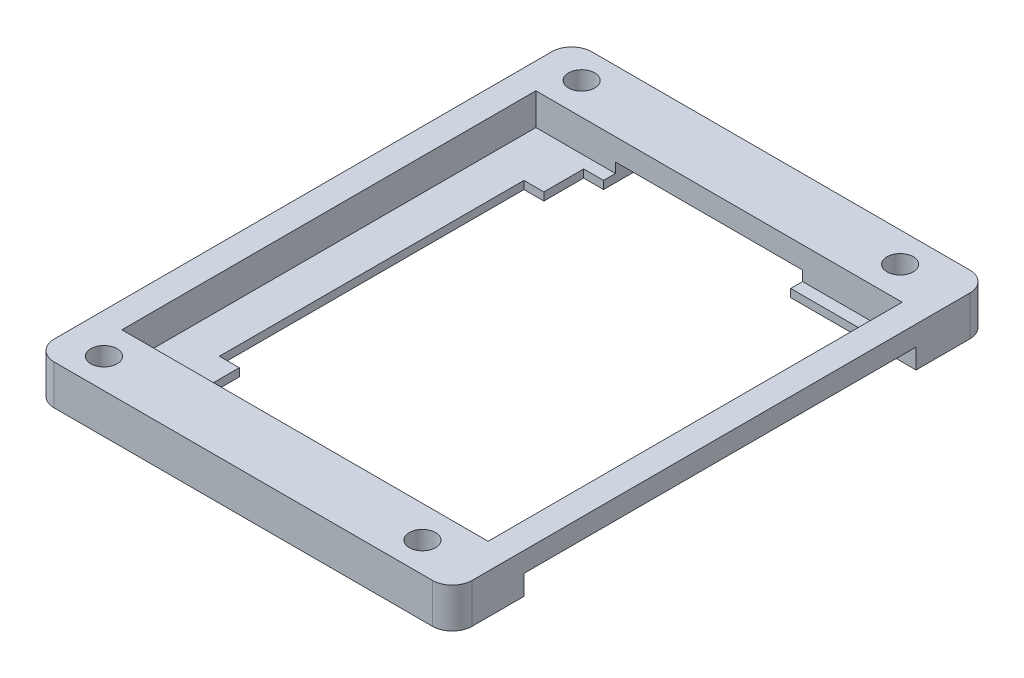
ISO-10303-21;
HEADER;
FILE_DESCRIPTION(('STEP AP214'),'2;1');
FILE_NAME('part.step','',(''),(''),'','','');
FILE_SCHEMA(('AUTOMOTIVE_DESIGN { 1 0 10303 214 1 1 1 1 }'));
ENDSEC;
DATA;
#1=APPLICATION_CONTEXT('core data for automotive mechanical design processes');
#2=APPLICATION_PROTOCOL_DEFINITION('international standard','automotive_design',2000,#1);
#3=PRODUCT_CONTEXT('',#1,'mechanical');
#4=PRODUCT('Part','Part','',(#3));
#5=PRODUCT_RELATED_PRODUCT_CATEGORY('part','',(#4));
#6=PRODUCT_DEFINITION_FORMATION('','',#4);
#7=PRODUCT_DEFINITION_CONTEXT('part definition',#1,'design');
#8=PRODUCT_DEFINITION('design','',#6,#7);
#9=PRODUCT_DEFINITION_SHAPE('','',#8);
#10=(LENGTH_UNIT() NAMED_UNIT(*) SI_UNIT(.MILLI.,.METRE.));
#11=(NAMED_UNIT(*) PLANE_ANGLE_UNIT() SI_UNIT($,.RADIAN.));
#12=(NAMED_UNIT(*) SI_UNIT($,.STERADIAN.) SOLID_ANGLE_UNIT());
#13=UNCERTAINTY_MEASURE_WITH_UNIT(LENGTH_MEASURE(1.E-05),#10,'distance_accuracy_value','');
#14=(GEOMETRIC_REPRESENTATION_CONTEXT(3) GLOBAL_UNCERTAINTY_ASSIGNED_CONTEXT((#13)) GLOBAL_UNIT_ASSIGNED_CONTEXT((#10,
#11,#12)) REPRESENTATION_CONTEXT('',''));
#15=CARTESIAN_POINT('',(0.,0.,0.));
#16=DIRECTION('',(0.,0.,1.));
#17=DIRECTION('',(1.,0.,0.));
#18=AXIS2_PLACEMENT_3D('',#15,#16,#17);
#19=CARTESIAN_POINT('',(-46.,10.,-52.));
#20=DIRECTION('',(0.,0.,1.));
#21=DIRECTION('',(1.,0.,0.));
#22=AXIS2_PLACEMENT_3D('',#19,#20,#21);
#23=PLANE('',#22);
#24=DIRECTION('',(-1.,0.,0.));
#25=VECTOR('',#24,1.);
#26=CARTESIAN_POINT('',(-26.,2.,-52.));
#27=LINE('',#26,#25);
#28=CARTESIAN_POINT('',(-26.,2.,-52.));
#29=VERTEX_POINT('',#28);
#30=CARTESIAN_POINT('',(-46.,2.,-52.));
#31=VERTEX_POINT('',#30);
#32=EDGE_CURVE('E319',#29,#31,#27,.T.);
#33=ORIENTED_EDGE('',*,*,#32,.F.);
#34=DIRECTION('',(0.,1.,0.));
#35=VECTOR('',#34,1.);
#36=CARTESIAN_POINT('',(-26.,-1.2E-05,-52.));
#37=LINE('',#36,#35);
#38=CARTESIAN_POINT('',(-26.,4.5,-52.));
#39=VERTEX_POINT('',#38);
#40=EDGE_CURVE('E265',#29,#39,#37,.T.);
#41=ORIENTED_EDGE('',*,*,#40,.T.);
#42=DIRECTION('',(-1.,0.,0.));
#43=VECTOR('',#42,1.);
#44=CARTESIAN_POINT('',(-26.,4.5,-52.));
#45=LINE('',#44,#43);
#46=CARTESIAN_POINT('',(21.,4.5,-52.));
#47=VERTEX_POINT('',#46);
#48=EDGE_CURVE('E255',#47,#39,#45,.T.);
#49=ORIENTED_EDGE('',*,*,#48,.F.);
#50=DIRECTION('',(0.,1.,0.));
#51=VECTOR('',#50,1.);
#52=CARTESIAN_POINT('',(21.,-1.2E-05,-52.));
#53=LINE('',#52,#51);
#54=CARTESIAN_POINT('',(21.,2.,-52.));
#55=VERTEX_POINT('',#54);
#56=EDGE_CURVE('E267',#55,#47,#53,.T.);
#57=ORIENTED_EDGE('',*,*,#56,.F.);
#58=DIRECTION('',(-1.,0.,0.));
#59=VECTOR('',#58,1.);
#60=CARTESIAN_POINT('',(46.,2.,-52.));
#61=LINE('',#60,#59);
#62=CARTESIAN_POINT('',(46.,2.,-52.));
#63=VERTEX_POINT('',#62);
#64=EDGE_CURVE('E306',#63,#55,#61,.T.);
#65=ORIENTED_EDGE('',*,*,#64,.F.);
#66=DIRECTION('',(0.,-1.,0.));
#67=VECTOR('',#66,1.);
#68=CARTESIAN_POINT('',(46.,10.,-52.));
#69=LINE('',#68,#67);
#70=CARTESIAN_POINT('',(46.,10.,-52.));
#71=VERTEX_POINT('',#70);
#72=EDGE_CURVE('E422',#71,#63,#69,.T.);
#73=ORIENTED_EDGE('',*,*,#72,.F.);
#74=DIRECTION('',(-1.,0.,0.));
#75=VECTOR('',#74,1.);
#76=CARTESIAN_POINT('',(-46.,10.,-52.));
#77=LINE('',#76,#75);
#78=CARTESIAN_POINT('',(-46.,10.,-52.));
#79=VERTEX_POINT('',#78);
#80=EDGE_CURVE('E406',#71,#79,#77,.T.);
#81=ORIENTED_EDGE('',*,*,#80,.T.);
#82=DIRECTION('',(0.,-1.,0.));
#83=VECTOR('',#82,1.);
#84=CARTESIAN_POINT('',(-46.,10.,-52.));
#85=LINE('',#84,#83);
#86=EDGE_CURVE('E419',#79,#31,#85,.T.);
#87=ORIENTED_EDGE('',*,*,#86,.T.);
#88=EDGE_LOOP('',(#33,#41,#49,#57,#65,#73,#81,#87));
#89=FACE_BOUND('',#88,.T.);
#90=ADVANCED_FACE('F39',(#89),#23,.T.);
#91=CARTESIAN_POINT('',(0.,0.,0.));
#92=DIRECTION('',(0.,-1.,0.));
#93=DIRECTION('',(0.,0.,-1.));
#94=AXIS2_PLACEMENT_3D('',#91,#92,#93);
#95=PLANE('',#94);
#96=CARTESIAN_POINT('',(-42.5,0.,60.));
#97=DIRECTION('',(0.,1.,0.));
#98=DIRECTION('',(0.,0.,1.));
#99=AXIS2_PLACEMENT_3D('',#96,#97,#98);
#100=CIRCLE('',#99,3.3);
#101=CARTESIAN_POINT('',(-42.5,0.,63.3));
#102=VERTEX_POINT('',#101);
#103=EDGE_CURVE('E384',#102,#102,#100,.T.);
#104=ORIENTED_EDGE('',*,*,#103,.T.);
#105=EDGE_LOOP('',(#104));
#106=FACE_BOUND('',#105,.T.);
#107=CARTESIAN_POINT('',(-42.5,0.,-60.));
#108=DIRECTION('',(0.,1.,0.));
#109=DIRECTION('',(0.,0.,1.));
#110=AXIS2_PLACEMENT_3D('',#107,#108,#109);
#111=CIRCLE('',#110,3.3);
#112=CARTESIAN_POINT('',(-42.5,0.,-56.7));
#113=VERTEX_POINT('',#112);
#114=EDGE_CURVE('E396',#113,#113,#111,.T.);
#115=ORIENTED_EDGE('',*,*,#114,.T.);
#116=EDGE_LOOP('',(#115));
#117=FACE_BOUND('',#116,.T.);
#118=CARTESIAN_POINT('',(37.5,0.,60.));
#119=DIRECTION('',(0.,1.,0.));
#120=DIRECTION('',(0.,0.,1.));
#121=AXIS2_PLACEMENT_3D('',#118,#119,#120);
#122=CIRCLE('',#121,3.3);
#123=CARTESIAN_POINT('',(37.5,0.,63.3));
#124=VERTEX_POINT('',#123);
#125=EDGE_CURVE('E380',#124,#124,#122,.T.);
#126=ORIENTED_EDGE('',*,*,#125,.T.);
#127=EDGE_LOOP('',(#126));
#128=FACE_BOUND('',#127,.T.);
#129=DIRECTION('',(0.,0.,-1.));
#130=VECTOR('',#129,1.);
#131=CARTESIAN_POINT('',(52.5,0.,67.5));
#132=LINE('',#131,#130);
#133=CARTESIAN_POINT('',(52.5,0.,62.5));
#134=VERTEX_POINT('',#133);
#135=CARTESIAN_POINT('',(52.5,0.,49.5156946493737));
#136=VERTEX_POINT('',#135);
#137=EDGE_CURVE('E438',#134,#136,#132,.T.);
#138=ORIENTED_EDGE('',*,*,#137,.F.);
#139=CARTESIAN_POINT('',(47.5,0.,62.5));
#140=DIRECTION('',(0.,-1.,0.));
#141=DIRECTION('',(0.,0.,-1.));
#142=AXIS2_PLACEMENT_3D('',#139,#140,#141);
#143=CIRCLE('',#142,5.);
#144=CARTESIAN_POINT('',(47.5,0.,67.5));
#145=VERTEX_POINT('',#144);
#146=EDGE_CURVE('E456',#134,#145,#143,.T.);
#147=ORIENTED_EDGE('',*,*,#146,.T.);
#148=DIRECTION('',(1.,0.,0.));
#149=VECTOR('',#148,1.);
#150=CARTESIAN_POINT('',(-52.5,0.,67.5));
#151=LINE('',#150,#149);
#152=CARTESIAN_POINT('',(-47.5,0.,67.5));
#153=VERTEX_POINT('',#152);
#154=EDGE_CURVE('E430',#153,#145,#151,.T.);
#155=ORIENTED_EDGE('',*,*,#154,.F.);
#156=CARTESIAN_POINT('',(-47.5,0.,62.5));
#157=DIRECTION('',(0.,-1.,0.));
#158=DIRECTION('',(0.,0.,-1.));
#159=AXIS2_PLACEMENT_3D('',#156,#157,#158);
#160=CIRCLE('',#159,5.);
#161=CARTESIAN_POINT('',(-52.5,0.,62.5));
#162=VERTEX_POINT('',#161);
#163=EDGE_CURVE('E454',#153,#162,#160,.T.);
#164=ORIENTED_EDGE('',*,*,#163,.T.);
#165=DIRECTION('',(0.,0.,1.));
#166=VECTOR('',#165,1.);
#167=CARTESIAN_POINT('',(-52.5,0.,67.5));
#168=LINE('',#167,#166);
#169=CARTESIAN_POINT('',(-52.5,0.,-62.5));
#170=VERTEX_POINT('',#169);
#171=EDGE_CURVE('E443',#170,#162,#168,.T.);
#172=ORIENTED_EDGE('',*,*,#171,.F.);
#173=CARTESIAN_POINT('',(-47.5,0.,-62.5));
#174=DIRECTION('',(0.,-1.,0.));
#175=DIRECTION('',(0.,0.,-1.));
#176=AXIS2_PLACEMENT_3D('',#173,#174,#175);
#177=CIRCLE('',#176,5.);
#178=CARTESIAN_POINT('',(-47.5,0.,-67.5));
#179=VERTEX_POINT('',#178);
#180=EDGE_CURVE('E452',#170,#179,#177,.T.);
#181=ORIENTED_EDGE('',*,*,#180,.T.);
#182=DIRECTION('',(-1.,0.,0.));
#183=VECTOR('',#182,1.);
#184=CARTESIAN_POINT('',(-52.5,0.,-67.5));
#185=LINE('',#184,#183);
#186=CARTESIAN_POINT('',(-26.,0.,-67.5));
#187=VERTEX_POINT('',#186);
#188=EDGE_CURVE('E440',#187,#179,#185,.T.);
#189=ORIENTED_EDGE('',*,*,#188,.F.);
#190=DIRECTION('',(0.,0.,-1.));
#191=VECTOR('',#190,1.);
#192=CARTESIAN_POINT('',(-26.,0.,-49.));
#193=LINE('',#192,#191);
#194=CARTESIAN_POINT('',(-26.,0.,-49.));
#195=VERTEX_POINT('',#194);
#196=EDGE_CURVE('E240',#195,#187,#193,.T.);
#197=ORIENTED_EDGE('',*,*,#196,.F.);
#198=DIRECTION('',(1.,0.,0.));
#199=VECTOR('',#198,1.);
#200=CARTESIAN_POINT('',(-31.,0.,-49.));
#201=LINE('',#200,#199);
#202=CARTESIAN_POINT('',(-31.,0.,-49.));
#203=VERTEX_POINT('',#202);
#204=EDGE_CURVE('E320',#203,#195,#201,.T.);
#205=ORIENTED_EDGE('',*,*,#204,.F.);
#206=DIRECTION('',(0.,0.,-1.));
#207=VECTOR('',#206,1.);
#208=CARTESIAN_POINT('',(-31.,0.,-49.));
#209=LINE('',#208,#207);
#210=CARTESIAN_POINT('',(-31.,0.,-39.));
#211=VERTEX_POINT('',#210);
#212=EDGE_CURVE('E355',#211,#203,#209,.T.);
#213=ORIENTED_EDGE('',*,*,#212,.F.);
#214=DIRECTION('',(1.,0.,0.));
#215=VECTOR('',#214,1.);
#216=CARTESIAN_POINT('',(-36.,0.,-39.));
#217=LINE('',#216,#215);
#218=CARTESIAN_POINT('',(-36.,0.,-39.));
#219=VERTEX_POINT('',#218);
#220=EDGE_CURVE('E353',#219,#211,#217,.T.);
#221=ORIENTED_EDGE('',*,*,#220,.F.);
#222=DIRECTION('',(0.,0.,-1.));
#223=VECTOR('',#222,1.);
#224=CARTESIAN_POINT('',(-36.,0.,37.5));
#225=LINE('',#224,#223);
#226=CARTESIAN_POINT('',(-36.,0.,37.5));
#227=VERTEX_POINT('',#226);
#228=EDGE_CURVE('E351',#227,#219,#225,.T.);
#229=ORIENTED_EDGE('',*,*,#228,.F.);
#230=DIRECTION('',(-1.,0.,0.));
#231=VECTOR('',#230,1.);
#232=CARTESIAN_POINT('',(-36.,0.,37.5));
#233=LINE('',#232,#231);
#234=CARTESIAN_POINT('',(-31.,0.,37.5));
#235=VERTEX_POINT('',#234);
#236=EDGE_CURVE('E349',#235,#227,#233,.T.);
#237=ORIENTED_EDGE('',*,*,#236,.F.);
#238=DIRECTION('',(0.,0.,-1.));
#239=VECTOR('',#238,1.);
#240=CARTESIAN_POINT('',(-31.,0.,49.5));
#241=LINE('',#240,#239);
#242=CARTESIAN_POINT('',(-31.,0.,49.5));
#243=VERTEX_POINT('',#242);
#244=EDGE_CURVE('E347',#243,#235,#241,.T.);
#245=ORIENTED_EDGE('',*,*,#244,.F.);
#246=DIRECTION('',(-1.,0.,0.));
#247=VECTOR('',#246,1.);
#248=CARTESIAN_POINT('',(41.,0.,49.5));
#249=LINE('',#248,#247);
#250=CARTESIAN_POINT('',(46.,0.,49.5));
#251=VERTEX_POINT('',#250);
#252=EDGE_CURVE('E345',#251,#243,#249,.T.);
#253=ORIENTED_EDGE('',*,*,#252,.F.);
#254=DIRECTION('',(0.,0.,1.));
#255=VECTOR('',#254,1.);
#256=CARTESIAN_POINT('',(46.,0.,-49.));
#257=LINE('',#256,#255);
#258=CARTESIAN_POINT('',(46.,0.,49.5156946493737));
#259=VERTEX_POINT('',#258);
#260=EDGE_CURVE('E279',#251,#259,#257,.T.);
#261=ORIENTED_EDGE('',*,*,#260,.T.);
#262=DIRECTION('',(1.,0.,0.));
#263=VECTOR('',#262,1.);
#264=CARTESIAN_POINT('',(46.,0.,49.5156946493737));
#265=LINE('',#264,#263);
#266=EDGE_CURVE('E282',#259,#136,#265,.T.);
#267=ORIENTED_EDGE('',*,*,#266,.T.);
#268=EDGE_LOOP('',(#138,#147,#155,#164,#172,#181,#189,#197,#205,#213,#221,#229,#237,#245,#253,
#261,#267));
#269=FACE_BOUND('',#268,.T.);
#270=ADVANCED_FACE('F490',(#106,#117,#128,#269),#95,.T.);
#271=CARTESIAN_POINT('',(37.5,0.,-60.));
#272=DIRECTION('',(0.,1.,0.));
#273=DIRECTION('',(0.,0.,1.));
#274=AXIS2_PLACEMENT_3D('',#271,#272,#273);
#275=CIRCLE('',#274,3.3);
#276=CARTESIAN_POINT('',(37.5,0.,-56.7));
#277=VERTEX_POINT('',#276);
#278=EDGE_CURVE('E390',#277,#277,#275,.T.);
#279=ORIENTED_EDGE('',*,*,#278,.T.);
#280=EDGE_LOOP('',(#279));
#281=FACE_BOUND('',#280,.T.);
#282=CARTESIAN_POINT('',(47.5,0.,-67.5));
#283=VERTEX_POINT('',#282);
#284=CARTESIAN_POINT('',(21.,0.,-67.5));
#285=VERTEX_POINT('',#284);
#286=EDGE_CURVE('E441',#283,#285,#185,.T.);
#287=ORIENTED_EDGE('',*,*,#286,.F.);
#288=CARTESIAN_POINT('',(47.5,0.,-62.5));
#289=DIRECTION('',(0.,-1.,0.));
#290=DIRECTION('',(0.,0.,-1.));
#291=AXIS2_PLACEMENT_3D('',#288,#289,#290);
#292=CIRCLE('',#291,5.);
#293=CARTESIAN_POINT('',(52.5,0.,-62.5));
#294=VERTEX_POINT('',#293);
#295=EDGE_CURVE('E11',#283,#294,#292,.T.);
#296=ORIENTED_EDGE('',*,*,#295,.T.);
#297=CARTESIAN_POINT('',(52.5,0.,-49.));
#298=VERTEX_POINT('',#297);
#299=EDGE_CURVE('E425',#298,#294,#132,.T.);
#300=ORIENTED_EDGE('',*,*,#299,.F.);
#301=DIRECTION('',(1.,0.,0.));
#302=VECTOR('',#301,1.);
#303=CARTESIAN_POINT('',(21.,0.,-49.));
#304=LINE('',#303,#302);
#305=CARTESIAN_POINT('',(21.,0.,-49.));
#306=VERTEX_POINT('',#305);
#307=EDGE_CURVE('E303',#306,#298,#304,.T.);
#308=ORIENTED_EDGE('',*,*,#307,.F.);
#309=DIRECTION('',(0.,0.,1.));
#310=VECTOR('',#309,1.);
#311=CARTESIAN_POINT('',(21.,0.,-52.));
#312=LINE('',#311,#310);
#313=EDGE_CURVE('E305',#285,#306,#312,.T.);
#314=ORIENTED_EDGE('',*,*,#313,.F.);
#315=EDGE_LOOP('',(#287,#296,#300,#308,#314));
#316=FACE_BOUND('',#315,.T.);
#317=ADVANCED_FACE('F530',(#281,#316),#95,.T.);
#318=CARTESIAN_POINT('',(-52.5,10.,-67.5));
#319=DIRECTION('',(0.,0.,1.));
#320=DIRECTION('',(1.,0.,0.));
#321=AXIS2_PLACEMENT_3D('',#318,#319,#320);
#322=PLANE('',#321);
#323=ORIENTED_EDGE('',*,*,#188,.T.);
#324=DIRECTION('',(0.,-1.,0.));
#325=VECTOR('',#324,1.);
#326=CARTESIAN_POINT('',(-47.5,10.,-67.5));
#327=LINE('',#326,#325);
#328=CARTESIAN_POINT('',(-47.5,10.,-67.5));
#329=VERTEX_POINT('',#328);
#330=EDGE_CURVE('E47',#179,#329,#327,.F.);
#331=ORIENTED_EDGE('',*,*,#330,.T.);
#332=DIRECTION('',(-1.,0.,0.));
#333=VECTOR('',#332,1.);
#334=CARTESIAN_POINT('',(-52.5,10.,-67.5));
#335=LINE('',#334,#333);
#336=CARTESIAN_POINT('',(47.5,10.,-67.5));
#337=VERTEX_POINT('',#336);
#338=EDGE_CURVE('E429',#337,#329,#335,.T.);
#339=ORIENTED_EDGE('',*,*,#338,.F.);
#340=DIRECTION('',(0.,-1.,0.));
#341=VECTOR('',#340,1.);
#342=CARTESIAN_POINT('',(47.5,10.,-67.5));
#343=LINE('',#342,#341);
#344=EDGE_CURVE('E475',#337,#283,#343,.T.);
#345=ORIENTED_EDGE('',*,*,#344,.T.);
#346=ORIENTED_EDGE('',*,*,#286,.T.);
#347=DIRECTION('',(0.,-1.,0.));
#348=VECTOR('',#347,1.);
#349=CARTESIAN_POINT('',(21.,10.,-67.5));
#350=LINE('',#349,#348);
#351=CARTESIAN_POINT('',(21.,4.5,-67.5));
#352=VERTEX_POINT('',#351);
#353=EDGE_CURVE('E246',#352,#285,#350,.T.);
#354=ORIENTED_EDGE('',*,*,#353,.F.);
#355=DIRECTION('',(1.,0.,0.));
#356=VECTOR('',#355,1.);
#357=CARTESIAN_POINT('',(-26.,4.5,-67.5));
#358=LINE('',#357,#356);
#359=CARTESIAN_POINT('',(-26.,4.5,-67.5));
#360=VERTEX_POINT('',#359);
#361=EDGE_CURVE('E252',#360,#352,#358,.T.);
#362=ORIENTED_EDGE('',*,*,#361,.F.);
#363=DIRECTION('',(0.,1.,0.));
#364=VECTOR('',#363,1.);
#365=CARTESIAN_POINT('',(-26.,10.,-67.5));
#366=LINE('',#365,#364);
#367=EDGE_CURVE('E233',#187,#360,#366,.T.);
#368=ORIENTED_EDGE('',*,*,#367,.F.);
#369=EDGE_LOOP('',(#323,#331,#339,#345,#346,#354,#362,#368));
#370=FACE_BOUND('',#369,.T.);
#371=ADVANCED_FACE('F258',(#370),#322,.F.);
#372=CARTESIAN_POINT('',(46.,10.,52.));
#373=DIRECTION('',(-1.,0.,0.));
#374=DIRECTION('',(0.,0.,1.));
#375=AXIS2_PLACEMENT_3D('',#372,#373,#374);
#376=PLANE('',#375);
#377=DIRECTION('',(0.,1.,0.));
#378=VECTOR('',#377,1.);
#379=CARTESIAN_POINT('',(46.,0.,-49.));
#380=LINE('',#379,#378);
#381=CARTESIAN_POINT('',(46.,2.,-49.));
#382=VERTEX_POINT('',#381);
#383=CARTESIAN_POINT('',(46.,5.,-49.));
#384=VERTEX_POINT('',#383);
#385=EDGE_CURVE('E286',#382,#384,#380,.T.);
#386=ORIENTED_EDGE('',*,*,#385,.T.);
#387=DIRECTION('',(0.,0.,1.));
#388=VECTOR('',#387,1.);
#389=CARTESIAN_POINT('',(46.,5.,-49.));
#390=LINE('',#389,#388);
#391=CARTESIAN_POINT('',(46.,5.,49.5156946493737));
#392=VERTEX_POINT('',#391);
#393=EDGE_CURVE('E269',#384,#392,#390,.T.);
#394=ORIENTED_EDGE('',*,*,#393,.T.);
#395=DIRECTION('',(0.,1.,0.));
#396=VECTOR('',#395,1.);
#397=CARTESIAN_POINT('',(46.,0.,49.5156946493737));
#398=LINE('',#397,#396);
#399=CARTESIAN_POINT('',(46.,2.,49.5156946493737));
#400=VERTEX_POINT('',#399);
#401=EDGE_CURVE('E285',#400,#392,#398,.T.);
#402=ORIENTED_EDGE('',*,*,#401,.F.);
#403=DIRECTION('',(0.,0.,-1.));
#404=VECTOR('',#403,1.);
#405=CARTESIAN_POINT('',(46.,2.,52.));
#406=LINE('',#405,#404);
#407=CARTESIAN_POINT('',(46.,2.,52.));
#408=VERTEX_POINT('',#407);
#409=EDGE_CURVE('E326',#408,#400,#406,.T.);
#410=ORIENTED_EDGE('',*,*,#409,.F.);
#411=DIRECTION('',(0.,-1.,0.));
#412=VECTOR('',#411,1.);
#413=CARTESIAN_POINT('',(46.,10.,52.));
#414=LINE('',#413,#412);
#415=CARTESIAN_POINT('',(46.,10.,52.));
#416=VERTEX_POINT('',#415);
#417=EDGE_CURVE('E413',#416,#408,#414,.T.);
#418=ORIENTED_EDGE('',*,*,#417,.F.);
#419=DIRECTION('',(0.,0.,-1.));
#420=VECTOR('',#419,1.);
#421=CARTESIAN_POINT('',(46.,10.,52.));
#422=LINE('',#421,#420);
#423=EDGE_CURVE('E402',#416,#71,#422,.T.);
#424=ORIENTED_EDGE('',*,*,#423,.T.);
#425=ORIENTED_EDGE('',*,*,#72,.T.);
#426=DIRECTION('',(0.,0.,-1.));
#427=VECTOR('',#426,1.);
#428=CARTESIAN_POINT('',(46.,2.,-49.));
#429=LINE('',#428,#427);
#430=EDGE_CURVE('E302',#382,#63,#429,.T.);
#431=ORIENTED_EDGE('',*,*,#430,.F.);
#432=EDGE_LOOP('',(#386,#394,#402,#410,#418,#424,#425,#431));
#433=FACE_BOUND('',#432,.T.);
#434=ADVANCED_FACE('F550',(#433),#376,.T.);
#435=CARTESIAN_POINT('',(0.,10.,0.));
#436=DIRECTION('',(0.,-1.,0.));
#437=DIRECTION('',(0.,0.,-1.));
#438=AXIS2_PLACEMENT_3D('',#435,#436,#437);
#439=PLANE('',#438);
#440=DIRECTION('',(1.,0.,0.));
#441=VECTOR('',#440,1.);
#442=CARTESIAN_POINT('',(-52.5,10.,67.5));
#443=LINE('',#442,#441);
#444=CARTESIAN_POINT('',(-47.5,10.,67.5));
#445=VERTEX_POINT('',#444);
#446=CARTESIAN_POINT('',(47.5,10.,67.5));
#447=VERTEX_POINT('',#446);
#448=EDGE_CURVE('E435',#445,#447,#443,.T.);
#449=ORIENTED_EDGE('',*,*,#448,.T.);
#450=CARTESIAN_POINT('',(47.5,10.,62.5));
#451=DIRECTION('',(0.,-1.,0.));
#452=DIRECTION('',(0.,0.,-1.));
#453=AXIS2_PLACEMENT_3D('',#450,#451,#452);
#454=CIRCLE('',#453,5.);
#455=CARTESIAN_POINT('',(52.5,10.,62.5));
#456=VERTEX_POINT('',#455);
#457=EDGE_CURVE('E469',#447,#456,#454,.F.);
#458=ORIENTED_EDGE('',*,*,#457,.T.);
#459=DIRECTION('',(0.,0.,-1.));
#460=VECTOR('',#459,1.);
#461=CARTESIAN_POINT('',(52.5,10.,67.5));
#462=LINE('',#461,#460);
#463=CARTESIAN_POINT('',(52.5,10.,-62.5));
#464=VERTEX_POINT('',#463);
#465=EDGE_CURVE('E426',#456,#464,#462,.T.);
#466=ORIENTED_EDGE('',*,*,#465,.T.);
#467=CARTESIAN_POINT('',(47.5,10.,-62.5));
#468=DIRECTION('',(0.,-1.,0.));
#469=DIRECTION('',(0.,0.,-1.));
#470=AXIS2_PLACEMENT_3D('',#467,#468,#469);
#471=CIRCLE('',#470,5.);
#472=EDGE_CURVE('E463',#464,#337,#471,.F.);
#473=ORIENTED_EDGE('',*,*,#472,.T.);
#474=ORIENTED_EDGE('',*,*,#338,.T.);
#475=CARTESIAN_POINT('',(-47.5,10.,-62.5));
#476=DIRECTION('',(0.,-1.,0.));
#477=DIRECTION('',(0.,0.,-1.));
#478=AXIS2_PLACEMENT_3D('',#475,#476,#477);
#479=CIRCLE('',#478,5.);
#480=CARTESIAN_POINT('',(-52.5,10.,-62.5));
#481=VERTEX_POINT('',#480);
#482=EDGE_CURVE('E465',#329,#481,#479,.F.);
#483=ORIENTED_EDGE('',*,*,#482,.T.);
#484=DIRECTION('',(0.,0.,1.));
#485=VECTOR('',#484,1.);
#486=CARTESIAN_POINT('',(-52.5,10.,67.5));
#487=LINE('',#486,#485);
#488=CARTESIAN_POINT('',(-52.5,10.,62.5));
#489=VERTEX_POINT('',#488);
#490=EDGE_CURVE('E433',#481,#489,#487,.T.);
#491=ORIENTED_EDGE('',*,*,#490,.T.);
#492=CARTESIAN_POINT('',(-47.5,10.,62.5));
#493=DIRECTION('',(0.,-1.,0.));
#494=DIRECTION('',(0.,0.,-1.));
#495=AXIS2_PLACEMENT_3D('',#492,#493,#494);
#496=CIRCLE('',#495,5.);
#497=EDGE_CURVE('E467',#489,#445,#496,.F.);
#498=ORIENTED_EDGE('',*,*,#497,.T.);
#499=EDGE_LOOP('',(#449,#458,#466,#473,#474,#483,#491,#498));
#500=FACE_BOUND('',#499,.T.);
#501=ORIENTED_EDGE('',*,*,#423,.F.);
#502=DIRECTION('',(1.,0.,0.));
#503=VECTOR('',#502,1.);
#504=CARTESIAN_POINT('',(-46.,10.,52.));
#505=LINE('',#504,#503);
#506=CARTESIAN_POINT('',(-46.,10.,52.));
#507=VERTEX_POINT('',#506);
#508=EDGE_CURVE('E411',#507,#416,#505,.T.);
#509=ORIENTED_EDGE('',*,*,#508,.F.);
#510=DIRECTION('',(0.,0.,1.));
#511=VECTOR('',#510,1.);
#512=CARTESIAN_POINT('',(-46.,10.,52.));
#513=LINE('',#512,#511);
#514=EDGE_CURVE('E408',#79,#507,#513,.T.);
#515=ORIENTED_EDGE('',*,*,#514,.F.);
#516=ORIENTED_EDGE('',*,*,#80,.F.);
#517=EDGE_LOOP('',(#501,#509,#515,#516));
#518=FACE_BOUND('',#517,.T.);
#519=CARTESIAN_POINT('',(-42.5,10.,-60.));
#520=DIRECTION('',(0.,1.,0.));
#521=DIRECTION('',(0.,0.,1.));
#522=AXIS2_PLACEMENT_3D('',#519,#520,#521);
#523=CIRCLE('',#522,3.3);
#524=CARTESIAN_POINT('',(-42.5,10.,-56.7));
#525=VERTEX_POINT('',#524);
#526=EDGE_CURVE('E399',#525,#525,#523,.T.);
#527=ORIENTED_EDGE('',*,*,#526,.F.);
#528=EDGE_LOOP('',(#527));
#529=FACE_BOUND('',#528,.T.);
#530=CARTESIAN_POINT('',(37.5,10.,-60.));
#531=DIRECTION('',(0.,1.,0.));
#532=DIRECTION('',(0.,0.,1.));
#533=AXIS2_PLACEMENT_3D('',#530,#531,#532);
#534=CIRCLE('',#533,3.3);
#535=CARTESIAN_POINT('',(37.5,10.,-56.7));
#536=VERTEX_POINT('',#535);
#537=EDGE_CURVE('E393',#536,#536,#534,.T.);
#538=ORIENTED_EDGE('',*,*,#537,.F.);
#539=EDGE_LOOP('',(#538));
#540=FACE_BOUND('',#539,.T.);
#541=CARTESIAN_POINT('',(-42.5,10.,60.));
#542=DIRECTION('',(0.,1.,0.));
#543=DIRECTION('',(0.,0.,1.));
#544=AXIS2_PLACEMENT_3D('',#541,#542,#543);
#545=CIRCLE('',#544,3.3);
#546=CARTESIAN_POINT('',(-42.5,10.,63.3));
#547=VERTEX_POINT('',#546);
#548=EDGE_CURVE('E387',#547,#547,#545,.T.);
#549=ORIENTED_EDGE('',*,*,#548,.F.);
#550=EDGE_LOOP('',(#549));
#551=FACE_BOUND('',#550,.T.);
#552=CARTESIAN_POINT('',(37.5,10.,60.));
#553=DIRECTION('',(0.,1.,0.));
#554=DIRECTION('',(0.,0.,1.));
#555=AXIS2_PLACEMENT_3D('',#552,#553,#554);
#556=CIRCLE('',#555,3.3);
#557=CARTESIAN_POINT('',(37.5,10.,63.3));
#558=VERTEX_POINT('',#557);
#559=EDGE_CURVE('E381',#558,#558,#556,.T.);
#560=ORIENTED_EDGE('',*,*,#559,.F.);
#561=EDGE_LOOP('',(#560));
#562=FACE_BOUND('',#561,.T.);
#563=ADVANCED_FACE('F481',(#500,#518,#529,#540,#551,#562),#439,.F.);
#564=CARTESIAN_POINT('',(52.5,10.,67.5));
#565=DIRECTION('',(-1.,0.,0.));
#566=DIRECTION('',(0.,0.,1.));
#567=AXIS2_PLACEMENT_3D('',#564,#565,#566);
#568=PLANE('',#567);
#569=ORIENTED_EDGE('',*,*,#465,.F.);
#570=DIRECTION('',(0.,-1.,0.));
#571=VECTOR('',#570,1.);
#572=CARTESIAN_POINT('',(52.5,10.,62.5));
#573=LINE('',#572,#571);
#574=EDGE_CURVE('E449',#456,#134,#573,.T.);
#575=ORIENTED_EDGE('',*,*,#574,.T.);
#576=ORIENTED_EDGE('',*,*,#137,.T.);
#577=DIRECTION('',(0.,1.,0.));
#578=VECTOR('',#577,1.);
#579=CARTESIAN_POINT('',(52.5,0.,49.5156946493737));
#580=LINE('',#579,#578);
#581=CARTESIAN_POINT('',(52.5,5.,49.5156946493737));
#582=VERTEX_POINT('',#581);
#583=EDGE_CURVE('E292',#136,#582,#580,.T.);
#584=ORIENTED_EDGE('',*,*,#583,.T.);
#585=DIRECTION('',(0.,0.,-1.));
#586=VECTOR('',#585,1.);
#587=CARTESIAN_POINT('',(52.5,5.,-49.));
#588=LINE('',#587,#586);
#589=CARTESIAN_POINT('',(52.5,5.,-49.));
#590=VERTEX_POINT('',#589);
#591=EDGE_CURVE('E274',#582,#590,#588,.T.);
#592=ORIENTED_EDGE('',*,*,#591,.T.);
#593=DIRECTION('',(0.,1.,0.));
#594=VECTOR('',#593,1.);
#595=CARTESIAN_POINT('',(52.5,0.,-49.));
#596=LINE('',#595,#594);
#597=EDGE_CURVE('E290',#298,#590,#596,.T.);
#598=ORIENTED_EDGE('',*,*,#597,.F.);
#599=ORIENTED_EDGE('',*,*,#299,.T.);
#600=DIRECTION('',(0.,-1.,0.));
#601=VECTOR('',#600,1.);
#602=CARTESIAN_POINT('',(52.5,10.,-62.5));
#603=LINE('',#602,#601);
#604=EDGE_CURVE('E245',#294,#464,#603,.F.);
#605=ORIENTED_EDGE('',*,*,#604,.T.);
#606=EDGE_LOOP('',(#569,#575,#576,#584,#592,#598,#599,#605));
#607=FACE_BOUND('',#606,.T.);
#608=ADVANCED_FACE('F506',(#607),#568,.F.);
#609=CARTESIAN_POINT('',(-52.5,10.,67.5));
#610=DIRECTION('',(1.,0.,0.));
#611=DIRECTION('',(0.,0.,-1.));
#612=AXIS2_PLACEMENT_3D('',#609,#610,#611);
#613=PLANE('',#612);
#614=ORIENTED_EDGE('',*,*,#171,.T.);
#615=DIRECTION('',(0.,-1.,0.));
#616=VECTOR('',#615,1.);
#617=CARTESIAN_POINT('',(-52.5,10.,62.5));
#618=LINE('',#617,#616);
#619=EDGE_CURVE('E60',#162,#489,#618,.F.);
#620=ORIENTED_EDGE('',*,*,#619,.T.);
#621=ORIENTED_EDGE('',*,*,#490,.F.);
#622=DIRECTION('',(0.,-1.,0.));
#623=VECTOR('',#622,1.);
#624=CARTESIAN_POINT('',(-52.5,10.,-62.5));
#625=LINE('',#624,#623);
#626=EDGE_CURVE('E471',#481,#170,#625,.T.);
#627=ORIENTED_EDGE('',*,*,#626,.T.);
#628=EDGE_LOOP('',(#614,#620,#621,#627));
#629=FACE_BOUND('',#628,.T.);
#630=ADVANCED_FACE('F487',(#629),#613,.F.);
#631=CARTESIAN_POINT('',(-52.5,10.,67.5));
#632=DIRECTION('',(0.,0.,-1.));
#633=DIRECTION('',(-1.,0.,0.));
#634=AXIS2_PLACEMENT_3D('',#631,#632,#633);
#635=PLANE('',#634);
#636=ORIENTED_EDGE('',*,*,#154,.T.);
#637=DIRECTION('',(0.,-1.,0.));
#638=VECTOR('',#637,1.);
#639=CARTESIAN_POINT('',(47.5,10.,67.5));
#640=LINE('',#639,#638);
#641=EDGE_CURVE('E461',#145,#447,#640,.F.);
#642=ORIENTED_EDGE('',*,*,#641,.T.);
#643=ORIENTED_EDGE('',*,*,#448,.F.);
#644=DIRECTION('',(0.,-1.,0.));
#645=VECTOR('',#644,1.);
#646=CARTESIAN_POINT('',(-47.5,10.,67.5));
#647=LINE('',#646,#645);
#648=EDGE_CURVE('E458',#445,#153,#647,.T.);
#649=ORIENTED_EDGE('',*,*,#648,.T.);
#650=EDGE_LOOP('',(#636,#642,#643,#649));
#651=FACE_BOUND('',#650,.T.);
#652=ADVANCED_FACE('F498',(#651),#635,.F.);
#653=CARTESIAN_POINT('',(-46.,10.,52.));
#654=DIRECTION('',(1.,0.,0.));
#655=DIRECTION('',(0.,0.,-1.));
#656=AXIS2_PLACEMENT_3D('',#653,#654,#655);
#657=PLANE('',#656);
#658=DIRECTION('',(0.,0.,1.));
#659=VECTOR('',#658,1.);
#660=CARTESIAN_POINT('',(-46.,2.,-52.));
#661=LINE('',#660,#659);
#662=CARTESIAN_POINT('',(-46.,2.,52.));
#663=VERTEX_POINT('',#662);
#664=EDGE_CURVE('E322',#31,#663,#661,.T.);
#665=ORIENTED_EDGE('',*,*,#664,.F.);
#666=ORIENTED_EDGE('',*,*,#86,.F.);
#667=ORIENTED_EDGE('',*,*,#514,.T.);
#668=DIRECTION('',(0.,-1.,0.));
#669=VECTOR('',#668,1.);
#670=CARTESIAN_POINT('',(-46.,10.,52.));
#671=LINE('',#670,#669);
#672=EDGE_CURVE('E416',#507,#663,#671,.T.);
#673=ORIENTED_EDGE('',*,*,#672,.T.);
#674=EDGE_LOOP('',(#665,#666,#667,#673));
#675=FACE_BOUND('',#674,.T.);
#676=ADVANCED_FACE('F548',(#675),#657,.T.);
#677=CARTESIAN_POINT('',(-46.,10.,52.));
#678=DIRECTION('',(0.,0.,-1.));
#679=DIRECTION('',(-1.,0.,0.));
#680=AXIS2_PLACEMENT_3D('',#677,#678,#679);
#681=PLANE('',#680);
#682=DIRECTION('',(1.,0.,0.));
#683=VECTOR('',#682,1.);
#684=CARTESIAN_POINT('',(-46.,2.,52.));
#685=LINE('',#684,#683);
#686=EDGE_CURVE('E324',#663,#408,#685,.T.);
#687=ORIENTED_EDGE('',*,*,#686,.F.);
#688=ORIENTED_EDGE('',*,*,#672,.F.);
#689=ORIENTED_EDGE('',*,*,#508,.T.);
#690=ORIENTED_EDGE('',*,*,#417,.T.);
#691=EDGE_LOOP('',(#687,#688,#689,#690));
#692=FACE_BOUND('',#691,.T.);
#693=ADVANCED_FACE('F791',(#692),#681,.T.);
#694=CARTESIAN_POINT('',(-42.5,10.,-60.));
#695=DIRECTION('',(0.,-1.,0.));
#696=DIRECTION('',(0.,0.,-1.));
#697=AXIS2_PLACEMENT_3D('',#694,#695,#696);
#698=CYLINDRICAL_SURFACE('',#697,3.3);
#699=ORIENTED_EDGE('',*,*,#526,.T.);
#700=EDGE_LOOP('',(#699));
#701=FACE_BOUND('',#700,.T.);
#702=ORIENTED_EDGE('',*,*,#114,.F.);
#703=EDGE_LOOP('',(#702));
#704=FACE_BOUND('',#703,.T.);
#705=ADVANCED_FACE('F782',(#701,#704),#698,.F.);
#706=CARTESIAN_POINT('',(37.5,10.,-60.));
#707=DIRECTION('',(0.,-1.,0.));
#708=DIRECTION('',(0.,0.,-1.));
#709=AXIS2_PLACEMENT_3D('',#706,#707,#708);
#710=CYLINDRICAL_SURFACE('',#709,3.3);
#711=ORIENTED_EDGE('',*,*,#537,.T.);
#712=EDGE_LOOP('',(#711));
#713=FACE_BOUND('',#712,.T.);
#714=ORIENTED_EDGE('',*,*,#278,.F.);
#715=EDGE_LOOP('',(#714));
#716=FACE_BOUND('',#715,.T.);
#717=ADVANCED_FACE('F773',(#713,#716),#710,.F.);
#718=CARTESIAN_POINT('',(-42.5,10.,60.));
#719=DIRECTION('',(0.,-1.,0.));
#720=DIRECTION('',(0.,0.,-1.));
#721=AXIS2_PLACEMENT_3D('',#718,#719,#720);
#722=CYLINDRICAL_SURFACE('',#721,3.3);
#723=ORIENTED_EDGE('',*,*,#548,.T.);
#724=EDGE_LOOP('',(#723));
#725=FACE_BOUND('',#724,.T.);
#726=ORIENTED_EDGE('',*,*,#103,.F.);
#727=EDGE_LOOP('',(#726));
#728=FACE_BOUND('',#727,.T.);
#729=ADVANCED_FACE('F764',(#725,#728),#722,.F.);
#730=CARTESIAN_POINT('',(37.5,10.,60.));
#731=DIRECTION('',(0.,-1.,0.));
#732=DIRECTION('',(0.,0.,-1.));
#733=AXIS2_PLACEMENT_3D('',#730,#731,#732);
#734=CYLINDRICAL_SURFACE('',#733,3.3);
#735=ORIENTED_EDGE('',*,*,#559,.T.);
#736=EDGE_LOOP('',(#735));
#737=FACE_BOUND('',#736,.T.);
#738=ORIENTED_EDGE('',*,*,#125,.F.);
#739=EDGE_LOOP('',(#738));
#740=FACE_BOUND('',#739,.T.);
#741=ADVANCED_FACE('F751',(#737,#740),#734,.F.);
#742=CARTESIAN_POINT('',(-26.,2.,-49.));
#743=DIRECTION('',(-1.,0.,0.));
#744=DIRECTION('',(0.,0.,1.));
#745=AXIS2_PLACEMENT_3D('',#742,#743,#744);
#746=PLANE('',#745);
#747=ORIENTED_EDGE('',*,*,#196,.T.);
#748=ORIENTED_EDGE('',*,*,#367,.T.);
#749=DIRECTION('',(0.,0.,-1.));
#750=VECTOR('',#749,1.);
#751=CARTESIAN_POINT('',(-26.,4.5,-52.));
#752=LINE('',#751,#750);
#753=EDGE_CURVE('E236',#39,#360,#752,.T.);
#754=ORIENTED_EDGE('',*,*,#753,.F.);
#755=ORIENTED_EDGE('',*,*,#40,.F.);
#756=DIRECTION('',(0.,0.,-1.));
#757=VECTOR('',#756,1.);
#758=CARTESIAN_POINT('',(-26.,2.,-49.));
#759=LINE('',#758,#757);
#760=CARTESIAN_POINT('',(-26.,2.,-49.));
#761=VERTEX_POINT('',#760);
#762=EDGE_CURVE('E316',#761,#29,#759,.T.);
#763=ORIENTED_EDGE('',*,*,#762,.F.);
#764=DIRECTION('',(0.,-1.,0.));
#765=VECTOR('',#764,1.);
#766=CARTESIAN_POINT('',(-26.,2.,-49.));
#767=LINE('',#766,#765);
#768=EDGE_CURVE('E343',#761,#195,#767,.T.);
#769=ORIENTED_EDGE('',*,*,#768,.T.);
#770=EDGE_LOOP('',(#747,#748,#754,#755,#763,#769));
#771=FACE_BOUND('',#770,.T.);
#772=ADVANCED_FACE('F235',(#771),#746,.F.);
#773=CARTESIAN_POINT('',(41.,2.,49.5));
#774=DIRECTION('',(0.,0.,1.));
#775=DIRECTION('',(1.,0.,0.));
#776=AXIS2_PLACEMENT_3D('',#773,#774,#775);
#777=PLANE('',#776);
#778=ORIENTED_EDGE('',*,*,#252,.T.);
#779=DIRECTION('',(0.,-1.,0.));
#780=VECTOR('',#779,1.);
#781=CARTESIAN_POINT('',(-31.,2.,49.5));
#782=LINE('',#781,#780);
#783=CARTESIAN_POINT('',(-31.,2.,49.5));
#784=VERTEX_POINT('',#783);
#785=EDGE_CURVE('E374',#784,#243,#782,.T.);
#786=ORIENTED_EDGE('',*,*,#785,.F.);
#787=DIRECTION('',(-1.,0.,0.));
#788=VECTOR('',#787,1.);
#789=CARTESIAN_POINT('',(41.,2.,49.5));
#790=LINE('',#789,#788);
#791=CARTESIAN_POINT('',(46.,2.,49.5));
#792=VERTEX_POINT('',#791);
#793=EDGE_CURVE('E329',#792,#784,#790,.T.);
#794=ORIENTED_EDGE('',*,*,#793,.F.);
#795=DIRECTION('',(0.,-1.,0.));
#796=VECTOR('',#795,1.);
#797=CARTESIAN_POINT('',(46.,2.,49.5));
#798=LINE('',#797,#796);
#799=EDGE_CURVE('E377',#792,#251,#798,.T.);
#800=ORIENTED_EDGE('',*,*,#799,.T.);
#801=EDGE_LOOP('',(#778,#786,#794,#800));
#802=FACE_BOUND('',#801,.T.);
#803=ADVANCED_FACE('F734',(#802),#777,.F.);
#804=CARTESIAN_POINT('',(-31.,2.,49.5));
#805=DIRECTION('',(-1.,0.,0.));
#806=DIRECTION('',(0.,0.,1.));
#807=AXIS2_PLACEMENT_3D('',#804,#805,#806);
#808=PLANE('',#807);
#809=ORIENTED_EDGE('',*,*,#244,.T.);
#810=DIRECTION('',(0.,-1.,0.));
#811=VECTOR('',#810,1.);
#812=CARTESIAN_POINT('',(-31.,2.,37.5));
#813=LINE('',#812,#811);
#814=CARTESIAN_POINT('',(-31.,2.,37.5));
#815=VERTEX_POINT('',#814);
#816=EDGE_CURVE('E371',#815,#235,#813,.T.);
#817=ORIENTED_EDGE('',*,*,#816,.F.);
#818=DIRECTION('',(0.,0.,-1.));
#819=VECTOR('',#818,1.);
#820=CARTESIAN_POINT('',(-31.,2.,49.5));
#821=LINE('',#820,#819);
#822=EDGE_CURVE('E331',#784,#815,#821,.T.);
#823=ORIENTED_EDGE('',*,*,#822,.F.);
#824=ORIENTED_EDGE('',*,*,#785,.T.);
#825=EDGE_LOOP('',(#809,#817,#823,#824));
#826=FACE_BOUND('',#825,.T.);
#827=ADVANCED_FACE('F725',(#826),#808,.F.);
#828=CARTESIAN_POINT('',(-36.,2.,37.5));
#829=DIRECTION('',(0.,0.,1.));
#830=DIRECTION('',(1.,0.,0.));
#831=AXIS2_PLACEMENT_3D('',#828,#829,#830);
#832=PLANE('',#831);
#833=ORIENTED_EDGE('',*,*,#236,.T.);
#834=DIRECTION('',(0.,-1.,0.));
#835=VECTOR('',#834,1.);
#836=CARTESIAN_POINT('',(-36.,2.,37.5));
#837=LINE('',#836,#835);
#838=CARTESIAN_POINT('',(-36.,2.,37.5));
#839=VERTEX_POINT('',#838);
#840=EDGE_CURVE('E368',#839,#227,#837,.T.);
#841=ORIENTED_EDGE('',*,*,#840,.F.);
#842=DIRECTION('',(-1.,0.,0.));
#843=VECTOR('',#842,1.);
#844=CARTESIAN_POINT('',(-36.,2.,37.5));
#845=LINE('',#844,#843);
#846=EDGE_CURVE('E333',#815,#839,#845,.T.);
#847=ORIENTED_EDGE('',*,*,#846,.F.);
#848=ORIENTED_EDGE('',*,*,#816,.T.);
#849=EDGE_LOOP('',(#833,#841,#847,#848));
#850=FACE_BOUND('',#849,.T.);
#851=ADVANCED_FACE('F716',(#850),#832,.F.);
#852=CARTESIAN_POINT('',(-36.,2.,37.5));
#853=DIRECTION('',(-1.,0.,0.));
#854=DIRECTION('',(0.,0.,1.));
#855=AXIS2_PLACEMENT_3D('',#852,#853,#854);
#856=PLANE('',#855);
#857=ORIENTED_EDGE('',*,*,#228,.T.);
#858=DIRECTION('',(0.,-1.,0.));
#859=VECTOR('',#858,1.);
#860=CARTESIAN_POINT('',(-36.,2.,-39.));
#861=LINE('',#860,#859);
#862=CARTESIAN_POINT('',(-36.,2.,-39.));
#863=VERTEX_POINT('',#862);
#864=EDGE_CURVE('E365',#863,#219,#861,.T.);
#865=ORIENTED_EDGE('',*,*,#864,.F.);
#866=DIRECTION('',(0.,0.,-1.));
#867=VECTOR('',#866,1.);
#868=CARTESIAN_POINT('',(-36.,2.,37.5));
#869=LINE('',#868,#867);
#870=EDGE_CURVE('E335',#839,#863,#869,.T.);
#871=ORIENTED_EDGE('',*,*,#870,.F.);
#872=ORIENTED_EDGE('',*,*,#840,.T.);
#873=EDGE_LOOP('',(#857,#865,#871,#872));
#874=FACE_BOUND('',#873,.T.);
#875=ADVANCED_FACE('F707',(#874),#856,.F.);
#876=CARTESIAN_POINT('',(-36.,2.,-39.));
#877=DIRECTION('',(0.,0.,-1.));
#878=DIRECTION('',(-1.,0.,0.));
#879=AXIS2_PLACEMENT_3D('',#876,#877,#878);
#880=PLANE('',#879);
#881=ORIENTED_EDGE('',*,*,#220,.T.);
#882=DIRECTION('',(0.,-1.,0.));
#883=VECTOR('',#882,1.);
#884=CARTESIAN_POINT('',(-31.,2.,-39.));
#885=LINE('',#884,#883);
#886=CARTESIAN_POINT('',(-31.,2.,-39.));
#887=VERTEX_POINT('',#886);
#888=EDGE_CURVE('E362',#887,#211,#885,.T.);
#889=ORIENTED_EDGE('',*,*,#888,.F.);
#890=DIRECTION('',(1.,0.,0.));
#891=VECTOR('',#890,1.);
#892=CARTESIAN_POINT('',(-36.,2.,-39.));
#893=LINE('',#892,#891);
#894=EDGE_CURVE('E337',#863,#887,#893,.T.);
#895=ORIENTED_EDGE('',*,*,#894,.F.);
#896=ORIENTED_EDGE('',*,*,#864,.T.);
#897=EDGE_LOOP('',(#881,#889,#895,#896));
#898=FACE_BOUND('',#897,.T.);
#899=ADVANCED_FACE('F698',(#898),#880,.F.);
#900=CARTESIAN_POINT('',(-31.,2.,-49.));
#901=DIRECTION('',(-1.,0.,0.));
#902=DIRECTION('',(0.,0.,1.));
#903=AXIS2_PLACEMENT_3D('',#900,#901,#902);
#904=PLANE('',#903);
#905=ORIENTED_EDGE('',*,*,#212,.T.);
#906=DIRECTION('',(0.,-1.,0.));
#907=VECTOR('',#906,1.);
#908=CARTESIAN_POINT('',(-31.,2.,-49.));
#909=LINE('',#908,#907);
#910=CARTESIAN_POINT('',(-31.,2.,-49.));
#911=VERTEX_POINT('',#910);
#912=EDGE_CURVE('E359',#911,#203,#909,.T.);
#913=ORIENTED_EDGE('',*,*,#912,.F.);
#914=DIRECTION('',(0.,0.,-1.));
#915=VECTOR('',#914,1.);
#916=CARTESIAN_POINT('',(-31.,2.,-49.));
#917=LINE('',#916,#915);
#918=EDGE_CURVE('E339',#887,#911,#917,.T.);
#919=ORIENTED_EDGE('',*,*,#918,.F.);
#920=ORIENTED_EDGE('',*,*,#888,.T.);
#921=EDGE_LOOP('',(#905,#913,#919,#920));
#922=FACE_BOUND('',#921,.T.);
#923=ADVANCED_FACE('F689',(#922),#904,.F.);
#924=CARTESIAN_POINT('',(-31.,2.,-49.));
#925=DIRECTION('',(0.,0.,-1.));
#926=DIRECTION('',(-1.,0.,0.));
#927=AXIS2_PLACEMENT_3D('',#924,#925,#926);
#928=PLANE('',#927);
#929=ORIENTED_EDGE('',*,*,#204,.T.);
#930=ORIENTED_EDGE('',*,*,#768,.F.);
#931=DIRECTION('',(1.,0.,0.));
#932=VECTOR('',#931,1.);
#933=CARTESIAN_POINT('',(-31.,2.,-49.));
#934=LINE('',#933,#932);
#935=EDGE_CURVE('E341',#911,#761,#934,.T.);
#936=ORIENTED_EDGE('',*,*,#935,.F.);
#937=ORIENTED_EDGE('',*,*,#912,.T.);
#938=EDGE_LOOP('',(#929,#930,#936,#937));
#939=FACE_BOUND('',#938,.T.);
#940=ADVANCED_FACE('F680',(#939),#928,.F.);
#941=CARTESIAN_POINT('',(0.,2.,0.));
#942=DIRECTION('',(0.,1.,0.));
#943=DIRECTION('',(0.,0.,1.));
#944=AXIS2_PLACEMENT_3D('',#941,#942,#943);
#945=PLANE('',#944);
#946=ORIENTED_EDGE('',*,*,#762,.T.);
#947=ORIENTED_EDGE('',*,*,#32,.T.);
#948=ORIENTED_EDGE('',*,*,#664,.T.);
#949=ORIENTED_EDGE('',*,*,#686,.T.);
#950=ORIENTED_EDGE('',*,*,#409,.T.);
#951=DIRECTION('',(0.,0.,1.));
#952=VECTOR('',#951,1.);
#953=CARTESIAN_POINT('',(46.,2.,0.));
#954=LINE('',#953,#952);
#955=EDGE_CURVE('E289',#792,#400,#954,.T.);
#956=ORIENTED_EDGE('',*,*,#955,.F.);
#957=ORIENTED_EDGE('',*,*,#793,.T.);
#958=ORIENTED_EDGE('',*,*,#822,.T.);
#959=ORIENTED_EDGE('',*,*,#846,.T.);
#960=ORIENTED_EDGE('',*,*,#870,.T.);
#961=ORIENTED_EDGE('',*,*,#894,.T.);
#962=ORIENTED_EDGE('',*,*,#918,.T.);
#963=ORIENTED_EDGE('',*,*,#935,.T.);
#964=EDGE_LOOP('',(#946,#947,#948,#949,#950,#956,#957,#958,#959,#960,#961,#962,#963));
#965=FACE_BOUND('',#964,.T.);
#966=ADVANCED_FACE('F671',(#965),#945,.T.);
#967=CARTESIAN_POINT('',(21.,2.,-52.));
#968=DIRECTION('',(1.,0.,0.));
#969=DIRECTION('',(0.,0.,-1.));
#970=AXIS2_PLACEMENT_3D('',#967,#968,#969);
#971=PLANE('',#970);
#972=ORIENTED_EDGE('',*,*,#313,.T.);
#973=DIRECTION('',(0.,-1.,0.));
#974=VECTOR('',#973,1.);
#975=CARTESIAN_POINT('',(21.,2.,-49.));
#976=LINE('',#975,#974);
#977=CARTESIAN_POINT('',(21.,2.,-49.));
#978=VERTEX_POINT('',#977);
#979=EDGE_CURVE('E299',#978,#306,#976,.T.);
#980=ORIENTED_EDGE('',*,*,#979,.F.);
#981=DIRECTION('',(0.,0.,1.));
#982=VECTOR('',#981,1.);
#983=CARTESIAN_POINT('',(21.,2.,-52.));
#984=LINE('',#983,#982);
#985=EDGE_CURVE('E312',#55,#978,#984,.T.);
#986=ORIENTED_EDGE('',*,*,#985,.F.);
#987=ORIENTED_EDGE('',*,*,#56,.T.);
#988=DIRECTION('',(0.,0.,1.));
#989=VECTOR('',#988,1.);
#990=CARTESIAN_POINT('',(21.,4.5,-52.));
#991=LINE('',#990,#989);
#992=EDGE_CURVE('E260',#352,#47,#991,.T.);
#993=ORIENTED_EDGE('',*,*,#992,.F.);
#994=ORIENTED_EDGE('',*,*,#353,.T.);
#995=EDGE_LOOP('',(#972,#980,#986,#987,#993,#994));
#996=FACE_BOUND('',#995,.T.);
#997=ADVANCED_FACE('F663',(#996),#971,.F.);
#998=CARTESIAN_POINT('',(21.,2.,-49.));
#999=DIRECTION('',(0.,0.,-1.));
#1000=DIRECTION('',(-1.,0.,0.));
#1001=AXIS2_PLACEMENT_3D('',#998,#999,#1000);
#1002=PLANE('',#1001);
#1003=ORIENTED_EDGE('',*,*,#307,.T.);
#1004=ORIENTED_EDGE('',*,*,#597,.T.);
#1005=DIRECTION('',(-1.,0.,0.));
#1006=VECTOR('',#1005,1.);
#1007=CARTESIAN_POINT('',(46.,5.,-49.));
#1008=LINE('',#1007,#1006);
#1009=EDGE_CURVE('E277',#590,#384,#1008,.T.);
#1010=ORIENTED_EDGE('',*,*,#1009,.T.);
#1011=ORIENTED_EDGE('',*,*,#385,.F.);
#1012=DIRECTION('',(1.,0.,0.));
#1013=VECTOR('',#1012,1.);
#1014=CARTESIAN_POINT('',(21.,2.,-49.));
#1015=LINE('',#1014,#1013);
#1016=EDGE_CURVE('E309',#978,#382,#1015,.T.);
#1017=ORIENTED_EDGE('',*,*,#1016,.F.);
#1018=ORIENTED_EDGE('',*,*,#979,.T.);
#1019=EDGE_LOOP('',(#1003,#1004,#1010,#1011,#1017,#1018));
#1020=FACE_BOUND('',#1019,.T.);
#1021=ADVANCED_FACE('F523',(#1020),#1002,.F.);
#1022=CARTESIAN_POINT('',(0.,2.,0.));
#1023=DIRECTION('',(0.,1.,0.));
#1024=DIRECTION('',(0.,0.,1.));
#1025=AXIS2_PLACEMENT_3D('',#1022,#1023,#1024);
#1026=PLANE('',#1025);
#1027=ORIENTED_EDGE('',*,*,#64,.T.);
#1028=ORIENTED_EDGE('',*,*,#985,.T.);
#1029=ORIENTED_EDGE('',*,*,#1016,.T.);
#1030=ORIENTED_EDGE('',*,*,#430,.T.);
#1031=EDGE_LOOP('',(#1027,#1028,#1029,#1030));
#1032=FACE_BOUND('',#1031,.T.);
#1033=ADVANCED_FACE('F645',(#1032),#1026,.T.);
#1034=CARTESIAN_POINT('',(46.,0.,-49.));
#1035=DIRECTION('',(-1.,0.,0.));
#1036=DIRECTION('',(0.,0.,1.));
#1037=AXIS2_PLACEMENT_3D('',#1034,#1035,#1036);
#1038=PLANE('',#1037);
#1039=ORIENTED_EDGE('',*,*,#955,.T.);
#1040=EDGE_CURVE('E295',#259,#400,#398,.T.);
#1041=ORIENTED_EDGE('',*,*,#1040,.F.);
#1042=ORIENTED_EDGE('',*,*,#260,.F.);
#1043=ORIENTED_EDGE('',*,*,#799,.F.);
#1044=EDGE_LOOP('',(#1039,#1041,#1042,#1043));
#1045=FACE_BOUND('',#1044,.T.);
#1046=ADVANCED_FACE('F637',(#1045),#1038,.F.);
#1047=CARTESIAN_POINT('',(46.,0.,49.5156946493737));
#1048=DIRECTION('',(0.,0.,1.));
#1049=DIRECTION('',(1.,0.,0.));
#1050=AXIS2_PLACEMENT_3D('',#1047,#1048,#1049);
#1051=PLANE('',#1050);
#1052=ORIENTED_EDGE('',*,*,#583,.F.);
#1053=ORIENTED_EDGE('',*,*,#266,.F.);
#1054=ORIENTED_EDGE('',*,*,#1040,.T.);
#1055=ORIENTED_EDGE('',*,*,#401,.T.);
#1056=DIRECTION('',(1.,0.,0.));
#1057=VECTOR('',#1056,1.);
#1058=CARTESIAN_POINT('',(46.,5.,49.5156946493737));
#1059=LINE('',#1058,#1057);
#1060=EDGE_CURVE('E272',#392,#582,#1059,.T.);
#1061=ORIENTED_EDGE('',*,*,#1060,.T.);
#1062=EDGE_LOOP('',(#1052,#1053,#1054,#1055,#1061));
#1063=FACE_BOUND('',#1062,.T.);
#1064=ADVANCED_FACE('F511',(#1063),#1051,.F.);
#1065=CARTESIAN_POINT('',(0.,5.,0.));
#1066=DIRECTION('',(0.,1.,0.));
#1067=DIRECTION('',(0.,0.,1.));
#1068=AXIS2_PLACEMENT_3D('',#1065,#1066,#1067);
#1069=PLANE('',#1068);
#1070=ORIENTED_EDGE('',*,*,#393,.F.);
#1071=ORIENTED_EDGE('',*,*,#1009,.F.);
#1072=ORIENTED_EDGE('',*,*,#591,.F.);
#1073=ORIENTED_EDGE('',*,*,#1060,.F.);
#1074=EDGE_LOOP('',(#1070,#1071,#1072,#1073));
#1075=FACE_BOUND('',#1074,.T.);
#1076=ADVANCED_FACE('F521',(#1075),#1069,.F.);
#1077=CARTESIAN_POINT('',(0.,4.5,0.));
#1078=DIRECTION('',(0.,-1.,0.));
#1079=DIRECTION('',(0.,0.,-1.));
#1080=AXIS2_PLACEMENT_3D('',#1077,#1078,#1079);
#1081=PLANE('',#1080);
#1082=ORIENTED_EDGE('',*,*,#753,.T.);
#1083=ORIENTED_EDGE('',*,*,#361,.T.);
#1084=ORIENTED_EDGE('',*,*,#992,.T.);
#1085=ORIENTED_EDGE('',*,*,#48,.T.);
#1086=EDGE_LOOP('',(#1082,#1083,#1084,#1085));
#1087=FACE_BOUND('',#1086,.T.);
#1088=ADVANCED_FACE('F250',(#1087),#1081,.T.);
#1089=CARTESIAN_POINT('',(47.5,10.,62.5));
#1090=DIRECTION('',(0.,-1.,0.));
#1091=DIRECTION('',(0.,0.,-1.));
#1092=AXIS2_PLACEMENT_3D('',#1089,#1090,#1091);
#1093=CYLINDRICAL_SURFACE('',#1092,5.);
#1094=ORIENTED_EDGE('',*,*,#457,.F.);
#1095=ORIENTED_EDGE('',*,*,#641,.F.);
#1096=ORIENTED_EDGE('',*,*,#146,.F.);
#1097=ORIENTED_EDGE('',*,*,#574,.F.);
#1098=EDGE_LOOP('',(#1094,#1095,#1096,#1097));
#1099=FACE_BOUND('',#1098,.T.);
#1100=ADVANCED_FACE('F504',(#1099),#1093,.T.);
#1101=CARTESIAN_POINT('',(-47.5,10.,62.5));
#1102=DIRECTION('',(0.,-1.,0.));
#1103=DIRECTION('',(0.,0.,-1.));
#1104=AXIS2_PLACEMENT_3D('',#1101,#1102,#1103);
#1105=CYLINDRICAL_SURFACE('',#1104,5.);
#1106=ORIENTED_EDGE('',*,*,#497,.F.);
#1107=ORIENTED_EDGE('',*,*,#619,.F.);
#1108=ORIENTED_EDGE('',*,*,#163,.F.);
#1109=ORIENTED_EDGE('',*,*,#648,.F.);
#1110=EDGE_LOOP('',(#1106,#1107,#1108,#1109));
#1111=FACE_BOUND('',#1110,.T.);
#1112=ADVANCED_FACE('F495',(#1111),#1105,.T.);
#1113=CARTESIAN_POINT('',(-47.5,10.,-62.5));
#1114=DIRECTION('',(0.,-1.,0.));
#1115=DIRECTION('',(0.,0.,-1.));
#1116=AXIS2_PLACEMENT_3D('',#1113,#1114,#1115);
#1117=CYLINDRICAL_SURFACE('',#1116,5.);
#1118=ORIENTED_EDGE('',*,*,#482,.F.);
#1119=ORIENTED_EDGE('',*,*,#330,.F.);
#1120=ORIENTED_EDGE('',*,*,#180,.F.);
#1121=ORIENTED_EDGE('',*,*,#626,.F.);
#1122=EDGE_LOOP('',(#1118,#1119,#1120,#1121));
#1123=FACE_BOUND('',#1122,.T.);
#1124=ADVANCED_FACE('F485',(#1123),#1117,.T.);
#1125=CARTESIAN_POINT('',(47.5,10.,-62.5));
#1126=DIRECTION('',(0.,-1.,0.));
#1127=DIRECTION('',(0.,0.,-1.));
#1128=AXIS2_PLACEMENT_3D('',#1125,#1126,#1127);
#1129=CYLINDRICAL_SURFACE('',#1128,5.);
#1130=ORIENTED_EDGE('',*,*,#472,.F.);
#1131=ORIENTED_EDGE('',*,*,#604,.F.);
#1132=ORIENTED_EDGE('',*,*,#295,.F.);
#1133=ORIENTED_EDGE('',*,*,#344,.F.);
#1134=EDGE_LOOP('',(#1130,#1131,#1132,#1133));
#1135=FACE_BOUND('',#1134,.T.);
#1136=ADVANCED_FACE('F41',(#1135),#1129,.T.);
#1137=CLOSED_SHELL('',(#90,#270,#317,#371,#434,#563,#608,#630,#652,#676,#693,#705,#717,#729,
#741,#772,#803,#827,#851,#875,#899,#923,#940,#966,#997,#1021,#1033,#1046,#1064,#1076,#1088,
#1100,#1112,#1124,#1136));
#1138=MANIFOLD_SOLID_BREP('B2',#1137);
#1139=ADVANCED_BREP_SHAPE_REPRESENTATION('',(#18,#1138),#14);
#1140=SHAPE_DEFINITION_REPRESENTATION(#9,#1139);
ENDSEC;
END-ISO-10303-21;
